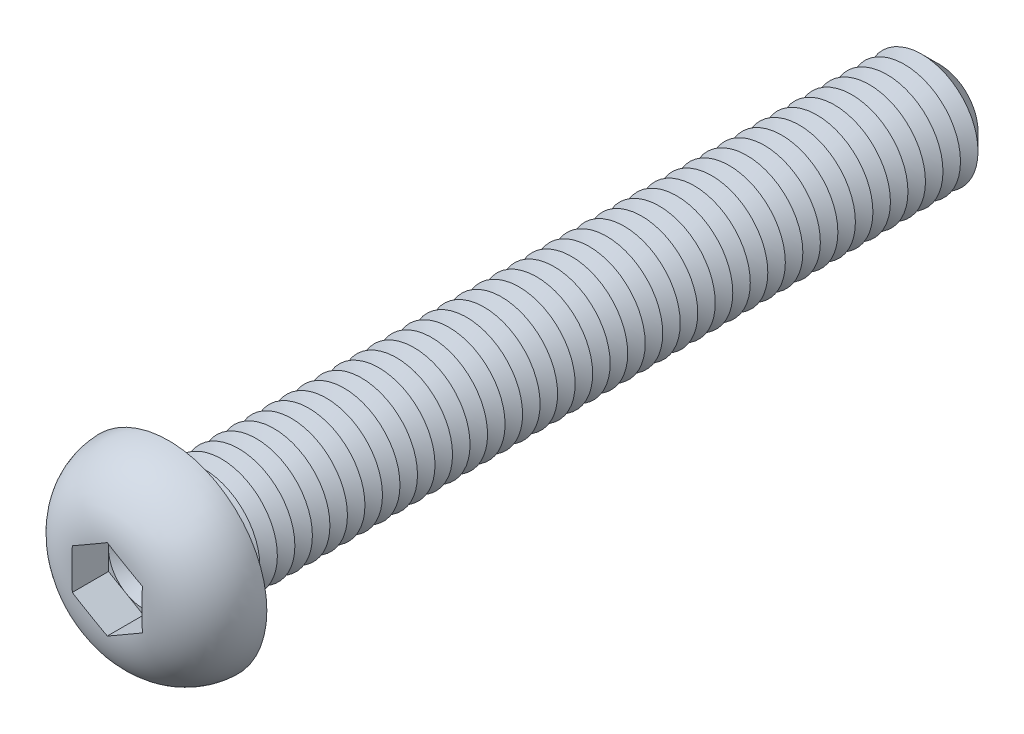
from build123d import *

# Parameters (mm, degrees)
CUT_EXTRUDE1_DEPTH  = 2.6
SKETCH4_R           = 4
BOSS_EXTRUDE1_DEPTH = 55
CHAMFER1_SIZE       = 1.25
LPATTERN1_COUNT     = 42
LPATTERN1_PITCH     = 1.25
FILLET2_R           = 0.5


with BuildPart() as part:
    # Sketch2 → Revolve1 (revolve)
    with BuildSketch(Plane(origin=(0, 0, 0), x_dir=(0, 0, -1), z_dir=(1, 0, 0)), mode=Mode.PRIVATE) as revolve1_sk:
        with BuildLine():
            Line((0, 0), (-4.4, 0))
            Line((-4.4, 0), (-4.4, 2.501111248))
            ThreePointArc((-4.4, 2.501111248), (-3.117141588, 5.647537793), (0, 7))
            Line((0, 7), (0, 0))
        make_face()
    revolve(revolve1_sk.sketch.rotate(Axis((0, 0, 47.934239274), (0, 0, -1)), 90), axis=Axis((0, 0, 47.934239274), (0, 0, -1)))

    # Sketch3 → Cut-Extrude1 (cut)
    with BuildSketch(Plane.XY.offset(4.4)):
        Polygon((0, 2.886751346), (-2.5, 1.443375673), (-2.5, -1.443375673), (0, -2.886751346), (2.5, -1.443375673), (2.5, 1.443375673), align=None)
    extrude(amount=-CUT_EXTRUDE1_DEPTH, mode=Mode.SUBTRACT)

    # Sketch4 → Boss-Extrude1 (add)
    with BuildSketch(Plane(origin=(0, 0, 0), x_dir=(-1, 0, 0), z_dir=(0, 0, -1))):
        with Locations(Location((0, 0, 0), (0, 0, 180))):
            Circle(SKETCH4_R)
    extrude(amount=BOSS_EXTRUDE1_DEPTH)

    # Chamfer1
    chamfer1_edges = [part.edges().sort_by_distance(p)[0] for p in [
        (-4, 0, -55),
    ]]
    chamfer(chamfer1_edges, length=CHAMFER1_SIZE)

    # Sketch5 → Cut-Revolve1 (revolve, cut)
    with BuildSketch(Plane(origin=(0, 0, 0), x_dir=(0, 0, -1), z_dir=(1, 0, 0)), mode=Mode.PRIVATE) as cut_revolve1_sk:
        Polygon((1.25, 4), (2.5, 4), (1.875, 2.917468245), align=None)
    cut_revolve1 = revolve(cut_revolve1_sk.sketch.rotate(Axis((0, 0, 47.934239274), (0, 0, -1)), 90), axis=Axis((0, 0, 47.934239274), (0, 0, -1)), mode=Mode.SUBTRACT)

    # LPattern1: Cut-Revolve1 ×42
    with Locations(*[(0, 0, -i * LPATTERN1_PITCH) for i in range(1, LPATTERN1_COUNT)]):
        add(cut_revolve1, mode=Mode.SUBTRACT)

    # Fillet2
    fillet2_edges = [part.edges().sort_by_distance(p)[0] for p in [
        (-4, 0, 0),
    ]]
    fillet(fillet2_edges, radius=FILLET2_R)

    # Cut-Extrude2 cone 1 section (on through the dimple's axis) → Cut-Extrude2 (revolve, cut)
    with BuildSketch(Plane(origin=(0, 0, 1.8), x_dir=(0, -1, 0), z_dir=(1, 0, 0))):
        Polygon((0, 0), (2.5, 0), (0, 1.443375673), align=None)
    revolve(axis=Axis((0, 0, 1.8), (0, 0, -1)), mode=Mode.SUBTRACT)


solid = part.part
